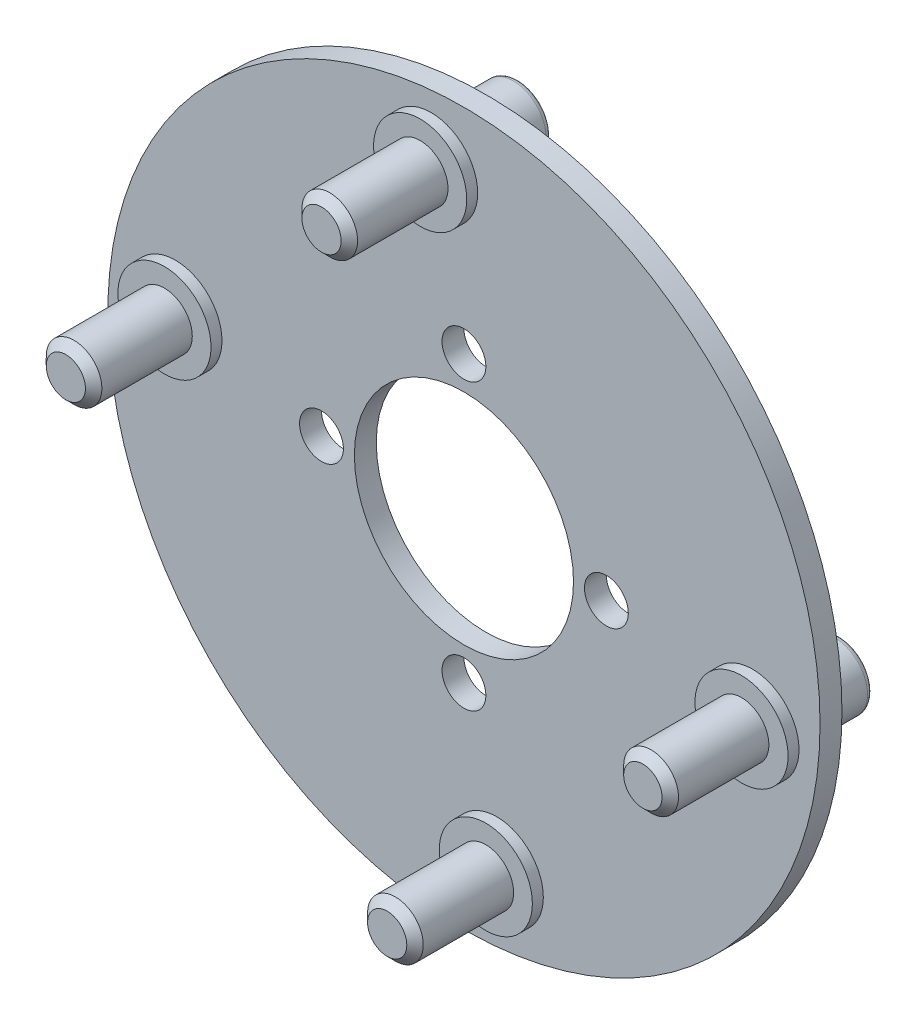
ISO-10303-21;
HEADER;
FILE_DESCRIPTION(('STEP AP214'),'2;1');
FILE_NAME('part.step','',(''),(''),'','','');
FILE_SCHEMA(('AUTOMOTIVE_DESIGN { 1 0 10303 214 1 1 1 1 }'));
ENDSEC;
DATA;
#1=APPLICATION_CONTEXT('core data for automotive mechanical design processes');
#2=APPLICATION_PROTOCOL_DEFINITION('international standard','automotive_design',2000,#1);
#3=PRODUCT_CONTEXT('',#1,'mechanical');
#4=PRODUCT('Part','Part','',(#3));
#5=PRODUCT_RELATED_PRODUCT_CATEGORY('part','',(#4));
#6=PRODUCT_DEFINITION_FORMATION('','',#4);
#7=PRODUCT_DEFINITION_CONTEXT('part definition',#1,'design');
#8=PRODUCT_DEFINITION('design','',#6,#7);
#9=PRODUCT_DEFINITION_SHAPE('','',#8);
#10=(LENGTH_UNIT() NAMED_UNIT(*) SI_UNIT(.MILLI.,.METRE.));
#11=(NAMED_UNIT(*) PLANE_ANGLE_UNIT() SI_UNIT($,.RADIAN.));
#12=(NAMED_UNIT(*) SI_UNIT($,.STERADIAN.) SOLID_ANGLE_UNIT());
#13=UNCERTAINTY_MEASURE_WITH_UNIT(LENGTH_MEASURE(1.E-05),#10,'distance_accuracy_value','');
#14=(GEOMETRIC_REPRESENTATION_CONTEXT(3) GLOBAL_UNCERTAINTY_ASSIGNED_CONTEXT((#13)) GLOBAL_UNIT_ASSIGNED_CONTEXT((#10,
#11,#12)) REPRESENTATION_CONTEXT('',''));
#15=CARTESIAN_POINT('',(0.,0.,0.));
#16=DIRECTION('',(0.,0.,1.));
#17=DIRECTION('',(1.,0.,0.));
#18=AXIS2_PLACEMENT_3D('',#15,#16,#17);
#19=CARTESIAN_POINT('',(2.9956164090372,-26.3301401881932,3.));
#20=DIRECTION('',(0.,0.,1.));
#21=DIRECTION('',(1.,0.,0.));
#22=AXIS2_PLACEMENT_3D('',#19,#20,#21);
#23=PLANE('',#22);
#24=CARTESIAN_POINT('',(2.9956164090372,-26.3301401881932,3.));
#25=DIRECTION('',(0.,0.,1.));
#26=DIRECTION('',(1.,0.,0.));
#27=AXIS2_PLACEMENT_3D('',#24,#25,#26);
#28=CIRCLE('',#27,4.25);
#29=CARTESIAN_POINT('',(7.2456164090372,-26.3301401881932,3.));
#30=VERTEX_POINT('',#29);
#31=EDGE_CURVE('E190',#30,#30,#28,.T.);
#32=ORIENTED_EDGE('',*,*,#31,.T.);
#33=EDGE_LOOP('',(#32));
#34=FACE_BOUND('',#33,.T.);
#35=CARTESIAN_POINT('',(2.9956164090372,-26.3301401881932,3.));
#36=DIRECTION('',(0.,0.,1.));
#37=DIRECTION('',(1.,0.,0.));
#38=AXIS2_PLACEMENT_3D('',#35,#36,#37);
#39=CIRCLE('',#38,2.53945180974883);
#40=CARTESIAN_POINT('',(5.53506821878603,-26.3301401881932,3.));
#41=VERTEX_POINT('',#40);
#42=EDGE_CURVE('E208',#41,#41,#39,.T.);
#43=ORIENTED_EDGE('',*,*,#42,.F.);
#44=EDGE_LOOP('',(#43));
#45=FACE_BOUND('',#44,.T.);
#46=ADVANCED_FACE('F35',(#34,#45),#23,.T.);
#47=CARTESIAN_POINT('',(-26.3301401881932,2.99561640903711,3.));
#48=DIRECTION('',(0.,0.,1.));
#49=DIRECTION('',(1.,0.,0.));
#50=AXIS2_PLACEMENT_3D('',#47,#48,#49);
#51=PLANE('',#50);
#52=CARTESIAN_POINT('',(-26.3301401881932,2.99561640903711,3.));
#53=DIRECTION('',(0.,0.,1.));
#54=DIRECTION('',(1.,0.,0.));
#55=AXIS2_PLACEMENT_3D('',#52,#53,#54);
#56=CIRCLE('',#55,4.25);
#57=CARTESIAN_POINT('',(-22.0801401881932,2.99561640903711,3.));
#58=VERTEX_POINT('',#57);
#59=EDGE_CURVE('E184',#58,#58,#56,.T.);
#60=ORIENTED_EDGE('',*,*,#59,.T.);
#61=EDGE_LOOP('',(#60));
#62=FACE_BOUND('',#61,.T.);
#63=CARTESIAN_POINT('',(-26.3301401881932,2.99561640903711,3.));
#64=DIRECTION('',(0.,0.,1.));
#65=DIRECTION('',(1.,0.,0.));
#66=AXIS2_PLACEMENT_3D('',#63,#64,#65);
#67=CIRCLE('',#66,2.53945180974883);
#68=CARTESIAN_POINT('',(-23.7906883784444,2.99561640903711,3.));
#69=VERTEX_POINT('',#68);
#70=EDGE_CURVE('E205',#69,#69,#67,.T.);
#71=ORIENTED_EDGE('',*,*,#70,.F.);
#72=EDGE_LOOP('',(#71));
#73=FACE_BOUND('',#72,.T.);
#74=ADVANCED_FACE('F215',(#62,#73),#51,.T.);
#75=CARTESIAN_POINT('',(26.3301401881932,-2.9956164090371,3.));
#76=DIRECTION('',(0.,0.,1.));
#77=DIRECTION('',(1.,0.,0.));
#78=AXIS2_PLACEMENT_3D('',#75,#76,#77);
#79=PLANE('',#78);
#80=CARTESIAN_POINT('',(26.3301401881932,-2.9956164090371,3.));
#81=DIRECTION('',(0.,0.,1.));
#82=DIRECTION('',(1.,0.,0.));
#83=AXIS2_PLACEMENT_3D('',#80,#81,#82);
#84=CIRCLE('',#83,4.25);
#85=CARTESIAN_POINT('',(30.5801401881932,-2.9956164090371,3.));
#86=VERTEX_POINT('',#85);
#87=EDGE_CURVE('E196',#86,#86,#84,.T.);
#88=ORIENTED_EDGE('',*,*,#87,.T.);
#89=EDGE_LOOP('',(#88));
#90=FACE_BOUND('',#89,.T.);
#91=CARTESIAN_POINT('',(26.3301401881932,-2.9956164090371,3.));
#92=DIRECTION('',(0.,0.,1.));
#93=DIRECTION('',(1.,0.,0.));
#94=AXIS2_PLACEMENT_3D('',#91,#92,#93);
#95=CIRCLE('',#94,2.5);
#96=CARTESIAN_POINT('',(28.8301401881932,-2.9956164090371,3.));
#97=VERTEX_POINT('',#96);
#98=EDGE_CURVE('E202',#97,#97,#95,.T.);
#99=ORIENTED_EDGE('',*,*,#98,.F.);
#100=EDGE_LOOP('',(#99));
#101=FACE_BOUND('',#100,.T.);
#102=ADVANCED_FACE('F221',(#90,#101),#79,.T.);
#103=CARTESIAN_POINT('',(-2.9956164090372,26.3301401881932,3.));
#104=DIRECTION('',(0.,0.,1.));
#105=DIRECTION('',(1.,0.,0.));
#106=AXIS2_PLACEMENT_3D('',#103,#104,#105);
#107=PLANE('',#106);
#108=CARTESIAN_POINT('',(-2.9956164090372,26.3301401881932,3.));
#109=DIRECTION('',(0.,0.,1.));
#110=DIRECTION('',(1.,0.,0.));
#111=AXIS2_PLACEMENT_3D('',#108,#109,#110);
#112=CIRCLE('',#111,4.25);
#113=CARTESIAN_POINT('',(1.2543835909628,26.3301401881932,3.));
#114=VERTEX_POINT('',#113);
#115=EDGE_CURVE('E178',#114,#114,#112,.T.);
#116=ORIENTED_EDGE('',*,*,#115,.T.);
#117=EDGE_LOOP('',(#116));
#118=FACE_BOUND('',#117,.T.);
#119=CARTESIAN_POINT('',(-2.9956164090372,26.3301401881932,3.));
#120=DIRECTION('',(0.,0.,1.));
#121=DIRECTION('',(1.,0.,0.));
#122=AXIS2_PLACEMENT_3D('',#119,#120,#121);
#123=CIRCLE('',#122,2.53945180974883);
#124=CARTESIAN_POINT('',(-0.456164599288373,26.3301401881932,3.));
#125=VERTEX_POINT('',#124);
#126=EDGE_CURVE('E199',#125,#125,#123,.T.);
#127=ORIENTED_EDGE('',*,*,#126,.F.);
#128=EDGE_LOOP('',(#127));
#129=FACE_BOUND('',#128,.T.);
#130=ADVANCED_FACE('F236',(#118,#129),#107,.T.);
#131=CARTESIAN_POINT('',(-26.3301401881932,2.99561640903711,-1.5));
#132=DIRECTION('',(0.,0.,1.));
#133=DIRECTION('',(1.,0.,0.));
#134=AXIS2_PLACEMENT_3D('',#131,#132,#133);
#135=PLANE('',#134);
#136=CARTESIAN_POINT('',(-26.3301401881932,2.99561640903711,-1.5));
#137=DIRECTION('',(0.,0.,1.));
#138=DIRECTION('',(1.,0.,0.));
#139=AXIS2_PLACEMENT_3D('',#136,#137,#138);
#140=CIRCLE('',#139,3.75);
#141=CARTESIAN_POINT('',(-22.5801401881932,2.99561640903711,-1.5));
#142=VERTEX_POINT('',#141);
#143=EDGE_CURVE('E103',#142,#142,#140,.F.);
#144=ORIENTED_EDGE('',*,*,#143,.T.);
#145=EDGE_LOOP('',(#144));
#146=FACE_BOUND('',#145,.T.);
#147=CARTESIAN_POINT('',(-26.3301401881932,2.99561640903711,-1.5));
#148=DIRECTION('',(0.,0.,1.));
#149=DIRECTION('',(1.,0.,0.));
#150=AXIS2_PLACEMENT_3D('',#147,#148,#149);
#151=CIRCLE('',#150,3.);
#152=CARTESIAN_POINT('',(-23.3301401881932,2.99561640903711,-1.5));
#153=VERTEX_POINT('',#152);
#154=EDGE_CURVE('E115',#153,#153,#151,.F.);
#155=ORIENTED_EDGE('',*,*,#154,.F.);
#156=EDGE_LOOP('',(#155));
#157=FACE_BOUND('',#156,.T.);
#158=ADVANCED_FACE('F234',(#146,#157),#135,.F.);
#159=CARTESIAN_POINT('',(2.9956164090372,-26.3301401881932,-1.5));
#160=DIRECTION('',(0.,0.,1.));
#161=DIRECTION('',(1.,0.,0.));
#162=AXIS2_PLACEMENT_3D('',#159,#160,#161);
#163=PLANE('',#162);
#164=CARTESIAN_POINT('',(2.9956164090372,-26.3301401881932,-1.5));
#165=DIRECTION('',(0.,0.,1.));
#166=DIRECTION('',(1.,0.,0.));
#167=AXIS2_PLACEMENT_3D('',#164,#165,#166);
#168=CIRCLE('',#167,3.75);
#169=CARTESIAN_POINT('',(6.7456164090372,-26.3301401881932,-1.5));
#170=VERTEX_POINT('',#169);
#171=EDGE_CURVE('E109',#170,#170,#168,.F.);
#172=ORIENTED_EDGE('',*,*,#171,.T.);
#173=EDGE_LOOP('',(#172));
#174=FACE_BOUND('',#173,.T.);
#175=CARTESIAN_POINT('',(2.9956164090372,-26.3301401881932,-1.5));
#176=DIRECTION('',(0.,0.,1.));
#177=DIRECTION('',(1.,0.,0.));
#178=AXIS2_PLACEMENT_3D('',#175,#176,#177);
#179=CIRCLE('',#178,3.);
#180=CARTESIAN_POINT('',(5.99561640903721,-26.3301401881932,-1.5));
#181=VERTEX_POINT('',#180);
#182=EDGE_CURVE('E118',#181,#181,#179,.F.);
#183=ORIENTED_EDGE('',*,*,#182,.F.);
#184=EDGE_LOOP('',(#183));
#185=FACE_BOUND('',#184,.T.);
#186=ADVANCED_FACE('F226',(#174,#185),#163,.F.);
#187=CARTESIAN_POINT('',(26.3301401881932,-2.9956164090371,-1.5));
#188=DIRECTION('',(0.,0.,1.));
#189=DIRECTION('',(1.,0.,0.));
#190=AXIS2_PLACEMENT_3D('',#187,#188,#189);
#191=PLANE('',#190);
#192=CARTESIAN_POINT('',(26.3301401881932,-2.9956164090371,-1.5));
#193=DIRECTION('',(0.,0.,1.));
#194=DIRECTION('',(1.,0.,0.));
#195=AXIS2_PLACEMENT_3D('',#192,#193,#194);
#196=CIRCLE('',#195,3.75);
#197=CARTESIAN_POINT('',(30.0801401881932,-2.9956164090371,-1.5));
#198=VERTEX_POINT('',#197);
#199=EDGE_CURVE('E91',#198,#198,#196,.F.);
#200=ORIENTED_EDGE('',*,*,#199,.T.);
#201=EDGE_LOOP('',(#200));
#202=FACE_BOUND('',#201,.T.);
#203=CARTESIAN_POINT('',(26.3301401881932,-2.9956164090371,-1.5));
#204=DIRECTION('',(0.,0.,1.));
#205=DIRECTION('',(1.,0.,0.));
#206=AXIS2_PLACEMENT_3D('',#203,#204,#205);
#207=CIRCLE('',#206,3.);
#208=CARTESIAN_POINT('',(29.3301401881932,-2.9956164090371,-1.5));
#209=VERTEX_POINT('',#208);
#210=EDGE_CURVE('E121',#209,#209,#207,.F.);
#211=ORIENTED_EDGE('',*,*,#210,.F.);
#212=EDGE_LOOP('',(#211));
#213=FACE_BOUND('',#212,.T.);
#214=ADVANCED_FACE('F248',(#202,#213),#191,.F.);
#215=CARTESIAN_POINT('',(-2.9956164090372,26.3301401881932,-1.5));
#216=DIRECTION('',(0.,0.,1.));
#217=DIRECTION('',(1.,0.,0.));
#218=AXIS2_PLACEMENT_3D('',#215,#216,#217);
#219=PLANE('',#218);
#220=CARTESIAN_POINT('',(-2.9956164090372,26.3301401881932,-1.5));
#221=DIRECTION('',(0.,0.,1.));
#222=DIRECTION('',(1.,0.,0.));
#223=AXIS2_PLACEMENT_3D('',#220,#221,#222);
#224=CIRCLE('',#223,3.75);
#225=CARTESIAN_POINT('',(0.754383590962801,26.3301401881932,-1.5));
#226=VERTEX_POINT('',#225);
#227=EDGE_CURVE('E97',#226,#226,#224,.F.);
#228=ORIENTED_EDGE('',*,*,#227,.T.);
#229=EDGE_LOOP('',(#228));
#230=FACE_BOUND('',#229,.T.);
#231=CARTESIAN_POINT('',(-2.9956164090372,26.3301401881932,-1.5));
#232=DIRECTION('',(0.,0.,1.));
#233=DIRECTION('',(1.,0.,0.));
#234=AXIS2_PLACEMENT_3D('',#231,#232,#233);
#235=CIRCLE('',#234,3.);
#236=CARTESIAN_POINT('',(0.00438359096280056,26.3301401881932,-1.5));
#237=VERTEX_POINT('',#236);
#238=EDGE_CURVE('E124',#237,#237,#235,.F.);
#239=ORIENTED_EDGE('',*,*,#238,.F.);
#240=EDGE_LOOP('',(#239));
#241=FACE_BOUND('',#240,.T.);
#242=ADVANCED_FACE('F244',(#230,#241),#219,.F.);
#243=CARTESIAN_POINT('',(0.,0.,2.));
#244=DIRECTION('',(0.,0.,1.));
#245=DIRECTION('',(1.,0.,0.));
#246=AXIS2_PLACEMENT_3D('',#243,#244,#245);
#247=PLANE('',#246);
#248=CARTESIAN_POINT('',(2.9956164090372,-26.3301401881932,2.));
#249=DIRECTION('',(0.,0.,1.));
#250=DIRECTION('',(1.,0.,0.));
#251=AXIS2_PLACEMENT_3D('',#248,#249,#250);
#252=CIRCLE('',#251,4.25);
#253=CARTESIAN_POINT('',(7.2456164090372,-26.3301401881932,2.));
#254=VERTEX_POINT('',#253);
#255=EDGE_CURVE('E187',#254,#254,#252,.F.);
#256=ORIENTED_EDGE('',*,*,#255,.T.);
#257=EDGE_LOOP('',(#256));
#258=FACE_BOUND('',#257,.T.);
#259=CARTESIAN_POINT('',(-2.9956164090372,26.3301401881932,2.));
#260=DIRECTION('',(0.,0.,1.));
#261=DIRECTION('',(1.,0.,0.));
#262=AXIS2_PLACEMENT_3D('',#259,#260,#261);
#263=CIRCLE('',#262,4.25);
#264=CARTESIAN_POINT('',(1.2543835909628,26.3301401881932,2.));
#265=VERTEX_POINT('',#264);
#266=EDGE_CURVE('E175',#265,#265,#263,.F.);
#267=ORIENTED_EDGE('',*,*,#266,.T.);
#268=EDGE_LOOP('',(#267));
#269=FACE_BOUND('',#268,.T.);
#270=CARTESIAN_POINT('',(-13.,1.36167851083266E-13,2.));
#271=DIRECTION('',(0.,0.,-1.));
#272=DIRECTION('',(0.,-1.,0.));
#273=AXIS2_PLACEMENT_3D('',#270,#271,#272);
#274=CIRCLE('',#273,2.);
#275=CARTESIAN_POINT('',(-13.,-1.99999999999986,2.));
#276=VERTEX_POINT('',#275);
#277=EDGE_CURVE('E169',#276,#276,#274,.T.);
#278=ORIENTED_EDGE('',*,*,#277,.T.);
#279=EDGE_LOOP('',(#278));
#280=FACE_BOUND('',#279,.T.);
#281=CARTESIAN_POINT('',(0.,-13.,2.));
#282=DIRECTION('',(0.,0.,-1.));
#283=DIRECTION('',(1.,0.,0.));
#284=AXIS2_PLACEMENT_3D('',#281,#282,#283);
#285=CIRCLE('',#284,2.);
#286=CARTESIAN_POINT('',(1.99999999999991,-13.,2.));
#287=VERTEX_POINT('',#286);
#288=EDGE_CURVE('E163',#287,#287,#285,.T.);
#289=ORIENTED_EDGE('',*,*,#288,.T.);
#290=EDGE_LOOP('',(#289));
#291=FACE_BOUND('',#290,.T.);
#292=CARTESIAN_POINT('',(13.,0.,2.));
#293=DIRECTION('',(0.,0.,-1.));
#294=DIRECTION('',(0.,1.,0.));
#295=AXIS2_PLACEMENT_3D('',#292,#293,#294);
#296=CIRCLE('',#295,2.);
#297=CARTESIAN_POINT('',(13.,1.99999999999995,2.));
#298=VERTEX_POINT('',#297);
#299=EDGE_CURVE('E157',#298,#298,#296,.T.);
#300=ORIENTED_EDGE('',*,*,#299,.T.);
#301=EDGE_LOOP('',(#300));
#302=FACE_BOUND('',#301,.T.);
#303=CARTESIAN_POINT('',(0.,13.,2.));
#304=DIRECTION('',(0.,0.,-1.));
#305=DIRECTION('',(-1.,0.,0.));
#306=AXIS2_PLACEMENT_3D('',#303,#304,#305);
#307=CIRCLE('',#306,2.);
#308=CARTESIAN_POINT('',(-2.,13.,2.));
#309=VERTEX_POINT('',#308);
#310=EDGE_CURVE('E151',#309,#309,#307,.T.);
#311=ORIENTED_EDGE('',*,*,#310,.T.);
#312=EDGE_LOOP('',(#311));
#313=FACE_BOUND('',#312,.T.);
#314=CARTESIAN_POINT('',(0.,0.,2.));
#315=DIRECTION('',(0.,0.,1.));
#316=DIRECTION('',(1.,0.,0.));
#317=AXIS2_PLACEMENT_3D('',#314,#315,#316);
#318=CIRCLE('',#317,32.5);
#319=CARTESIAN_POINT('',(32.5,0.,2.));
#320=VERTEX_POINT('',#319);
#321=EDGE_CURVE('E139',#320,#320,#318,.T.);
#322=ORIENTED_EDGE('',*,*,#321,.T.);
#323=EDGE_LOOP('',(#322));
#324=FACE_BOUND('',#323,.T.);
#325=CARTESIAN_POINT('',(0.,0.,2.));
#326=DIRECTION('',(0.,0.,1.));
#327=DIRECTION('',(1.,0.,0.));
#328=AXIS2_PLACEMENT_3D('',#325,#326,#327);
#329=CIRCLE('',#328,10.);
#330=CARTESIAN_POINT('',(10.,0.,2.));
#331=VERTEX_POINT('',#330);
#332=EDGE_CURVE('E145',#331,#331,#329,.T.);
#333=ORIENTED_EDGE('',*,*,#332,.F.);
#334=EDGE_LOOP('',(#333));
#335=FACE_BOUND('',#334,.T.);
#336=CARTESIAN_POINT('',(-26.3301401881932,2.99561640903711,2.));
#337=DIRECTION('',(0.,0.,1.));
#338=DIRECTION('',(1.,0.,0.));
#339=AXIS2_PLACEMENT_3D('',#336,#337,#338);
#340=CIRCLE('',#339,4.25);
#341=CARTESIAN_POINT('',(-22.0801401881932,2.99561640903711,2.));
#342=VERTEX_POINT('',#341);
#343=EDGE_CURVE('E181',#342,#342,#340,.F.);
#344=ORIENTED_EDGE('',*,*,#343,.T.);
#345=EDGE_LOOP('',(#344));
#346=FACE_BOUND('',#345,.T.);
#347=CARTESIAN_POINT('',(26.3301401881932,-2.9956164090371,2.));
#348=DIRECTION('',(0.,0.,1.));
#349=DIRECTION('',(1.,0.,0.));
#350=AXIS2_PLACEMENT_3D('',#347,#348,#349);
#351=CIRCLE('',#350,4.25);
#352=CARTESIAN_POINT('',(30.5801401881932,-2.9956164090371,2.));
#353=VERTEX_POINT('',#352);
#354=EDGE_CURVE('E193',#353,#353,#351,.F.);
#355=ORIENTED_EDGE('',*,*,#354,.T.);
#356=EDGE_LOOP('',(#355));
#357=FACE_BOUND('',#356,.T.);
#358=ADVANCED_FACE('F247',(#258,#269,#280,#291,#302,#313,#324,#335,#346,#357),#247,.T.);
#359=CARTESIAN_POINT('',(0.,0.,0.));
#360=DIRECTION('',(0.,0.,1.));
#361=DIRECTION('',(1.,0.,0.));
#362=AXIS2_PLACEMENT_3D('',#359,#360,#361);
#363=PLANE('',#362);
#364=CARTESIAN_POINT('',(2.9956164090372,-26.3301401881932,0.));
#365=DIRECTION('',(0.,0.,1.));
#366=DIRECTION('',(1.,0.,0.));
#367=AXIS2_PLACEMENT_3D('',#364,#365,#366);
#368=CIRCLE('',#367,4.25);
#369=CARTESIAN_POINT('',(7.2456164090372,-26.3301401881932,0.));
#370=VERTEX_POINT('',#369);
#371=EDGE_CURVE('E130',#370,#370,#368,.F.);
#372=ORIENTED_EDGE('',*,*,#371,.F.);
#373=EDGE_LOOP('',(#372));
#374=FACE_BOUND('',#373,.T.);
#375=CARTESIAN_POINT('',(-2.9956164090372,26.3301401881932,0.));
#376=DIRECTION('',(0.,0.,1.));
#377=DIRECTION('',(1.,0.,0.));
#378=AXIS2_PLACEMENT_3D('',#375,#376,#377);
#379=CIRCLE('',#378,4.25);
#380=CARTESIAN_POINT('',(1.2543835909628,26.3301401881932,0.));
#381=VERTEX_POINT('',#380);
#382=EDGE_CURVE('E136',#381,#381,#379,.F.);
#383=ORIENTED_EDGE('',*,*,#382,.F.);
#384=EDGE_LOOP('',(#383));
#385=FACE_BOUND('',#384,.T.);
#386=CARTESIAN_POINT('',(-13.,1.36167851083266E-13,0.));
#387=DIRECTION('',(0.,0.,-1.));
#388=DIRECTION('',(0.,-1.,0.));
#389=AXIS2_PLACEMENT_3D('',#386,#387,#388);
#390=CIRCLE('',#389,2.);
#391=CARTESIAN_POINT('',(-13.,-1.99999999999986,0.));
#392=VERTEX_POINT('',#391);
#393=EDGE_CURVE('E172',#392,#392,#390,.T.);
#394=ORIENTED_EDGE('',*,*,#393,.F.);
#395=EDGE_LOOP('',(#394));
#396=FACE_BOUND('',#395,.T.);
#397=CARTESIAN_POINT('',(0.,-13.,0.));
#398=DIRECTION('',(0.,0.,-1.));
#399=DIRECTION('',(1.,0.,0.));
#400=AXIS2_PLACEMENT_3D('',#397,#398,#399);
#401=CIRCLE('',#400,2.);
#402=CARTESIAN_POINT('',(1.99999999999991,-13.,0.));
#403=VERTEX_POINT('',#402);
#404=EDGE_CURVE('E166',#403,#403,#401,.T.);
#405=ORIENTED_EDGE('',*,*,#404,.F.);
#406=EDGE_LOOP('',(#405));
#407=FACE_BOUND('',#406,.T.);
#408=CARTESIAN_POINT('',(13.,0.,0.));
#409=DIRECTION('',(0.,0.,-1.));
#410=DIRECTION('',(0.,1.,0.));
#411=AXIS2_PLACEMENT_3D('',#408,#409,#410);
#412=CIRCLE('',#411,2.);
#413=CARTESIAN_POINT('',(13.,1.99999999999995,0.));
#414=VERTEX_POINT('',#413);
#415=EDGE_CURVE('E160',#414,#414,#412,.T.);
#416=ORIENTED_EDGE('',*,*,#415,.F.);
#417=EDGE_LOOP('',(#416));
#418=FACE_BOUND('',#417,.T.);
#419=CARTESIAN_POINT('',(0.,13.,0.));
#420=DIRECTION('',(0.,0.,-1.));
#421=DIRECTION('',(-1.,0.,0.));
#422=AXIS2_PLACEMENT_3D('',#419,#420,#421);
#423=CIRCLE('',#422,2.);
#424=CARTESIAN_POINT('',(-2.,13.,0.));
#425=VERTEX_POINT('',#424);
#426=EDGE_CURVE('E154',#425,#425,#423,.T.);
#427=ORIENTED_EDGE('',*,*,#426,.F.);
#428=EDGE_LOOP('',(#427));
#429=FACE_BOUND('',#428,.T.);
#430=CARTESIAN_POINT('',(0.,0.,0.));
#431=DIRECTION('',(0.,0.,1.));
#432=DIRECTION('',(1.,0.,0.));
#433=AXIS2_PLACEMENT_3D('',#430,#431,#432);
#434=CIRCLE('',#433,32.5);
#435=CARTESIAN_POINT('',(32.5,0.,0.));
#436=VERTEX_POINT('',#435);
#437=EDGE_CURVE('E142',#436,#436,#434,.T.);
#438=ORIENTED_EDGE('',*,*,#437,.F.);
#439=EDGE_LOOP('',(#438));
#440=FACE_BOUND('',#439,.T.);
#441=CARTESIAN_POINT('',(0.,0.,0.));
#442=DIRECTION('',(0.,0.,1.));
#443=DIRECTION('',(1.,0.,0.));
#444=AXIS2_PLACEMENT_3D('',#441,#442,#443);
#445=CIRCLE('',#444,10.);
#446=CARTESIAN_POINT('',(10.,0.,0.));
#447=VERTEX_POINT('',#446);
#448=EDGE_CURVE('E148',#447,#447,#445,.T.);
#449=ORIENTED_EDGE('',*,*,#448,.T.);
#450=EDGE_LOOP('',(#449));
#451=FACE_BOUND('',#450,.T.);
#452=CARTESIAN_POINT('',(-26.3301401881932,2.99561640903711,0.));
#453=DIRECTION('',(0.,0.,1.));
#454=DIRECTION('',(1.,0.,0.));
#455=AXIS2_PLACEMENT_3D('',#452,#453,#454);
#456=CIRCLE('',#455,4.25);
#457=CARTESIAN_POINT('',(-22.0801401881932,2.99561640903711,0.));
#458=VERTEX_POINT('',#457);
#459=EDGE_CURVE('E133',#458,#458,#456,.F.);
#460=ORIENTED_EDGE('',*,*,#459,.F.);
#461=EDGE_LOOP('',(#460));
#462=FACE_BOUND('',#461,.T.);
#463=CARTESIAN_POINT('',(26.3301401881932,-2.9956164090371,0.));
#464=DIRECTION('',(0.,0.,1.));
#465=DIRECTION('',(1.,0.,0.));
#466=AXIS2_PLACEMENT_3D('',#463,#464,#465);
#467=CIRCLE('',#466,4.25);
#468=CARTESIAN_POINT('',(30.5801401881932,-2.9956164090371,0.));
#469=VERTEX_POINT('',#468);
#470=EDGE_CURVE('E127',#469,#469,#467,.F.);
#471=ORIENTED_EDGE('',*,*,#470,.F.);
#472=EDGE_LOOP('',(#471));
#473=FACE_BOUND('',#472,.T.);
#474=ADVANCED_FACE('F278',(#374,#385,#396,#407,#418,#429,#440,#451,#462,#473),#363,.F.);
#475=CARTESIAN_POINT('',(0.,0.,2.));
#476=DIRECTION('',(0.,0.,-1.));
#477=DIRECTION('',(-1.,0.,0.));
#478=AXIS2_PLACEMENT_3D('',#475,#476,#477);
#479=CYLINDRICAL_SURFACE('',#478,32.5);
#480=ORIENTED_EDGE('',*,*,#321,.F.);
#481=EDGE_LOOP('',(#480));
#482=FACE_BOUND('',#481,.T.);
#483=ORIENTED_EDGE('',*,*,#437,.T.);
#484=EDGE_LOOP('',(#483));
#485=FACE_BOUND('',#484,.T.);
#486=ADVANCED_FACE('F37',(#482,#485),#479,.T.);
#487=CARTESIAN_POINT('',(0.,0.,2.));
#488=DIRECTION('',(0.,0.,-1.));
#489=DIRECTION('',(-1.,0.,0.));
#490=AXIS2_PLACEMENT_3D('',#487,#488,#489);
#491=CYLINDRICAL_SURFACE('',#490,10.);
#492=ORIENTED_EDGE('',*,*,#332,.T.);
#493=EDGE_LOOP('',(#492));
#494=FACE_BOUND('',#493,.T.);
#495=ORIENTED_EDGE('',*,*,#448,.F.);
#496=EDGE_LOOP('',(#495));
#497=FACE_BOUND('',#496,.T.);
#498=ADVANCED_FACE('F273',(#494,#497),#491,.F.);
#499=CARTESIAN_POINT('',(0.,13.,2.));
#500=DIRECTION('',(0.,0.,-1.));
#501=DIRECTION('',(-1.,0.,0.));
#502=AXIS2_PLACEMENT_3D('',#499,#500,#501);
#503=CYLINDRICAL_SURFACE('',#502,2.);
#504=ORIENTED_EDGE('',*,*,#310,.F.);
#505=EDGE_LOOP('',(#504));
#506=FACE_BOUND('',#505,.T.);
#507=ORIENTED_EDGE('',*,*,#426,.T.);
#508=EDGE_LOOP('',(#507));
#509=FACE_BOUND('',#508,.T.);
#510=ADVANCED_FACE('F269',(#506,#509),#503,.F.);
#511=CARTESIAN_POINT('',(13.,0.,2.));
#512=DIRECTION('',(0.,0.,-1.));
#513=DIRECTION('',(-1.,0.,0.));
#514=AXIS2_PLACEMENT_3D('',#511,#512,#513);
#515=CYLINDRICAL_SURFACE('',#514,2.);
#516=ORIENTED_EDGE('',*,*,#299,.F.);
#517=EDGE_LOOP('',(#516));
#518=FACE_BOUND('',#517,.T.);
#519=ORIENTED_EDGE('',*,*,#415,.T.);
#520=EDGE_LOOP('',(#519));
#521=FACE_BOUND('',#520,.T.);
#522=ADVANCED_FACE('F265',(#518,#521),#515,.F.);
#523=CARTESIAN_POINT('',(0.,-13.,2.));
#524=DIRECTION('',(0.,0.,-1.));
#525=DIRECTION('',(-1.,0.,0.));
#526=AXIS2_PLACEMENT_3D('',#523,#524,#525);
#527=CYLINDRICAL_SURFACE('',#526,2.);
#528=ORIENTED_EDGE('',*,*,#288,.F.);
#529=EDGE_LOOP('',(#528));
#530=FACE_BOUND('',#529,.T.);
#531=ORIENTED_EDGE('',*,*,#404,.T.);
#532=EDGE_LOOP('',(#531));
#533=FACE_BOUND('',#532,.T.);
#534=ADVANCED_FACE('F261',(#530,#533),#527,.F.);
#535=CARTESIAN_POINT('',(-13.,1.36167851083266E-13,2.));
#536=DIRECTION('',(0.,0.,-1.));
#537=DIRECTION('',(-1.,0.,0.));
#538=AXIS2_PLACEMENT_3D('',#535,#536,#537);
#539=CYLINDRICAL_SURFACE('',#538,2.);
#540=ORIENTED_EDGE('',*,*,#277,.F.);
#541=EDGE_LOOP('',(#540));
#542=FACE_BOUND('',#541,.T.);
#543=ORIENTED_EDGE('',*,*,#393,.T.);
#544=EDGE_LOOP('',(#543));
#545=FACE_BOUND('',#544,.T.);
#546=ADVANCED_FACE('F258',(#542,#545),#539,.F.);
#547=CARTESIAN_POINT('',(-2.9956164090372,26.3301401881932,3.));
#548=DIRECTION('',(0.,0.,-1.));
#549=DIRECTION('',(-1.,0.,0.));
#550=AXIS2_PLACEMENT_3D('',#547,#548,#549);
#551=CYLINDRICAL_SURFACE('',#550,4.25);
#552=CARTESIAN_POINT('',(-2.9956164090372,26.3301401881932,-1.));
#553=DIRECTION('',(0.,0.,1.));
#554=DIRECTION('',(1.,0.,0.));
#555=AXIS2_PLACEMENT_3D('',#552,#553,#554);
#556=CIRCLE('',#555,4.25);
#557=CARTESIAN_POINT('',(1.2543835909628,26.3301401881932,-1.));
#558=VERTEX_POINT('',#557);
#559=EDGE_CURVE('E100',#558,#558,#556,.T.);
#560=ORIENTED_EDGE('',*,*,#559,.T.);
#561=EDGE_LOOP('',(#560));
#562=FACE_BOUND('',#561,.T.);
#563=ORIENTED_EDGE('',*,*,#382,.T.);
#564=EDGE_LOOP('',(#563));
#565=FACE_BOUND('',#564,.T.);
#566=ADVANCED_FACE('F256',(#562,#565),#551,.T.);
#567=ORIENTED_EDGE('',*,*,#266,.F.);
#568=EDGE_LOOP('',(#567));
#569=FACE_BOUND('',#568,.T.);
#570=ORIENTED_EDGE('',*,*,#115,.F.);
#571=EDGE_LOOP('',(#570));
#572=FACE_BOUND('',#571,.T.);
#573=ADVANCED_FACE('F253',(#569,#572),#551,.T.);
#574=CARTESIAN_POINT('',(-26.3301401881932,2.99561640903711,3.));
#575=DIRECTION('',(0.,0.,-1.));
#576=DIRECTION('',(-1.,0.,0.));
#577=AXIS2_PLACEMENT_3D('',#574,#575,#576);
#578=CYLINDRICAL_SURFACE('',#577,4.25);
#579=CARTESIAN_POINT('',(-26.3301401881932,2.99561640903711,-1.));
#580=DIRECTION('',(0.,0.,1.));
#581=DIRECTION('',(1.,0.,0.));
#582=AXIS2_PLACEMENT_3D('',#579,#580,#581);
#583=CIRCLE('',#582,4.25);
#584=CARTESIAN_POINT('',(-22.0801401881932,2.99561640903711,-1.));
#585=VERTEX_POINT('',#584);
#586=EDGE_CURVE('E106',#585,#585,#583,.T.);
#587=ORIENTED_EDGE('',*,*,#586,.T.);
#588=EDGE_LOOP('',(#587));
#589=FACE_BOUND('',#588,.T.);
#590=ORIENTED_EDGE('',*,*,#459,.T.);
#591=EDGE_LOOP('',(#590));
#592=FACE_BOUND('',#591,.T.);
#593=ADVANCED_FACE('F242',(#589,#592),#578,.T.);
#594=ORIENTED_EDGE('',*,*,#343,.F.);
#595=EDGE_LOOP('',(#594));
#596=FACE_BOUND('',#595,.T.);
#597=ORIENTED_EDGE('',*,*,#59,.F.);
#598=EDGE_LOOP('',(#597));
#599=FACE_BOUND('',#598,.T.);
#600=ADVANCED_FACE('F239',(#596,#599),#578,.T.);
#601=CARTESIAN_POINT('',(2.9956164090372,-26.3301401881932,3.));
#602=DIRECTION('',(0.,0.,-1.));
#603=DIRECTION('',(-1.,0.,0.));
#604=AXIS2_PLACEMENT_3D('',#601,#602,#603);
#605=CYLINDRICAL_SURFACE('',#604,4.25);
#606=CARTESIAN_POINT('',(2.9956164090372,-26.3301401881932,-1.));
#607=DIRECTION('',(0.,0.,1.));
#608=DIRECTION('',(1.,0.,0.));
#609=AXIS2_PLACEMENT_3D('',#606,#607,#608);
#610=CIRCLE('',#609,4.25);
#611=CARTESIAN_POINT('',(7.2456164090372,-26.3301401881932,-1.));
#612=VERTEX_POINT('',#611);
#613=EDGE_CURVE('E112',#612,#612,#610,.T.);
#614=ORIENTED_EDGE('',*,*,#613,.T.);
#615=EDGE_LOOP('',(#614));
#616=FACE_BOUND('',#615,.T.);
#617=ORIENTED_EDGE('',*,*,#371,.T.);
#618=EDGE_LOOP('',(#617));
#619=FACE_BOUND('',#618,.T.);
#620=ADVANCED_FACE('F232',(#616,#619),#605,.T.);
#621=ORIENTED_EDGE('',*,*,#255,.F.);
#622=EDGE_LOOP('',(#621));
#623=FACE_BOUND('',#622,.T.);
#624=ORIENTED_EDGE('',*,*,#31,.F.);
#625=EDGE_LOOP('',(#624));
#626=FACE_BOUND('',#625,.T.);
#627=ADVANCED_FACE('F228',(#623,#626),#605,.T.);
#628=CARTESIAN_POINT('',(26.3301401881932,-2.9956164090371,3.));
#629=DIRECTION('',(0.,0.,-1.));
#630=DIRECTION('',(-1.,0.,0.));
#631=AXIS2_PLACEMENT_3D('',#628,#629,#630);
#632=CYLINDRICAL_SURFACE('',#631,4.25);
#633=CARTESIAN_POINT('',(26.3301401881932,-2.9956164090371,-1.));
#634=DIRECTION('',(0.,0.,1.));
#635=DIRECTION('',(1.,0.,0.));
#636=AXIS2_PLACEMENT_3D('',#633,#634,#635);
#637=CIRCLE('',#636,4.25);
#638=CARTESIAN_POINT('',(30.5801401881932,-2.9956164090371,-1.));
#639=VERTEX_POINT('',#638);
#640=EDGE_CURVE('E94',#639,#639,#637,.T.);
#641=ORIENTED_EDGE('',*,*,#640,.T.);
#642=EDGE_LOOP('',(#641));
#643=FACE_BOUND('',#642,.T.);
#644=ORIENTED_EDGE('',*,*,#470,.T.);
#645=EDGE_LOOP('',(#644));
#646=FACE_BOUND('',#645,.T.);
#647=ADVANCED_FACE('F231',(#643,#646),#632,.T.);
#648=ORIENTED_EDGE('',*,*,#354,.F.);
#649=EDGE_LOOP('',(#648));
#650=FACE_BOUND('',#649,.T.);
#651=ORIENTED_EDGE('',*,*,#87,.F.);
#652=EDGE_LOOP('',(#651));
#653=FACE_BOUND('',#652,.T.);
#654=ADVANCED_FACE('F305',(#650,#653),#632,.T.);
#655=CARTESIAN_POINT('',(-2.9956164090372,26.3301401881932,-6.));
#656=DIRECTION('',(0.,0.,1.));
#657=DIRECTION('',(1.,0.,0.));
#658=AXIS2_PLACEMENT_3D('',#655,#656,#657);
#659=CYLINDRICAL_SURFACE('',#658,3.);
#660=CARTESIAN_POINT('',(-2.9956164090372,26.3301401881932,-5.5));
#661=DIRECTION('',(0.,0.,-1.));
#662=DIRECTION('',(-1.,0.,0.));
#663=AXIS2_PLACEMENT_3D('',#660,#661,#662);
#664=CIRCLE('',#663,3.);
#665=CARTESIAN_POINT('',(-5.9956164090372,26.3301401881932,-5.5));
#666=VERTEX_POINT('',#665);
#667=EDGE_CURVE('E67',#666,#666,#664,.F.);
#668=ORIENTED_EDGE('',*,*,#667,.T.);
#669=EDGE_LOOP('',(#668));
#670=FACE_BOUND('',#669,.T.);
#671=ORIENTED_EDGE('',*,*,#238,.T.);
#672=EDGE_LOOP('',(#671));
#673=FACE_BOUND('',#672,.T.);
#674=ADVANCED_FACE('F308',(#670,#673),#659,.T.);
#675=CARTESIAN_POINT('',(-2.9956164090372,26.3301401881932,-6.));
#676=DIRECTION('',(0.,0.,-1.));
#677=DIRECTION('',(-1.,0.,0.));
#678=AXIS2_PLACEMENT_3D('',#675,#676,#677);
#679=PLANE('',#678);
#680=CARTESIAN_POINT('',(-2.9956164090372,26.3301401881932,-6.));
#681=DIRECTION('',(0.,0.,-1.));
#682=DIRECTION('',(-1.,0.,0.));
#683=AXIS2_PLACEMENT_3D('',#680,#681,#682);
#684=CIRCLE('',#683,2.5);
#685=CARTESIAN_POINT('',(-5.4956164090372,26.3301401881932,-6.));
#686=VERTEX_POINT('',#685);
#687=EDGE_CURVE('E70',#686,#686,#684,.T.);
#688=ORIENTED_EDGE('',*,*,#687,.T.);
#689=EDGE_LOOP('',(#688));
#690=FACE_BOUND('',#689,.T.);
#691=ADVANCED_FACE('F390',(#690),#679,.T.);
#692=CARTESIAN_POINT('',(26.3301401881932,-2.9956164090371,-6.));
#693=DIRECTION('',(0.,0.,1.));
#694=DIRECTION('',(1.,0.,0.));
#695=AXIS2_PLACEMENT_3D('',#692,#693,#694);
#696=CYLINDRICAL_SURFACE('',#695,3.);
#697=CARTESIAN_POINT('',(26.3301401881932,-2.9956164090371,-5.5));
#698=DIRECTION('',(0.,0.,-1.));
#699=DIRECTION('',(-1.,0.,0.));
#700=AXIS2_PLACEMENT_3D('',#697,#698,#699);
#701=CIRCLE('',#700,3.);
#702=CARTESIAN_POINT('',(23.3301401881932,-2.9956164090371,-5.5));
#703=VERTEX_POINT('',#702);
#704=EDGE_CURVE('E73',#703,#703,#701,.F.);
#705=ORIENTED_EDGE('',*,*,#704,.T.);
#706=EDGE_LOOP('',(#705));
#707=FACE_BOUND('',#706,.T.);
#708=ORIENTED_EDGE('',*,*,#210,.T.);
#709=EDGE_LOOP('',(#708));
#710=FACE_BOUND('',#709,.T.);
#711=ADVANCED_FACE('F386',(#707,#710),#696,.T.);
#712=CARTESIAN_POINT('',(26.3301401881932,-2.9956164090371,-6.));
#713=DIRECTION('',(0.,0.,-1.));
#714=DIRECTION('',(-1.,0.,0.));
#715=AXIS2_PLACEMENT_3D('',#712,#713,#714);
#716=PLANE('',#715);
#717=CARTESIAN_POINT('',(26.3301401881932,-2.9956164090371,-6.));
#718=DIRECTION('',(0.,0.,-1.));
#719=DIRECTION('',(-1.,0.,0.));
#720=AXIS2_PLACEMENT_3D('',#717,#718,#719);
#721=CIRCLE('',#720,2.5);
#722=CARTESIAN_POINT('',(23.8301401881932,-2.9956164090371,-6.));
#723=VERTEX_POINT('',#722);
#724=EDGE_CURVE('E76',#723,#723,#721,.T.);
#725=ORIENTED_EDGE('',*,*,#724,.T.);
#726=EDGE_LOOP('',(#725));
#727=FACE_BOUND('',#726,.T.);
#728=ADVANCED_FACE('F382',(#727),#716,.T.);
#729=CARTESIAN_POINT('',(2.9956164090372,-26.3301401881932,-6.));
#730=DIRECTION('',(0.,0.,1.));
#731=DIRECTION('',(1.,0.,0.));
#732=AXIS2_PLACEMENT_3D('',#729,#730,#731);
#733=CYLINDRICAL_SURFACE('',#732,3.);
#734=CARTESIAN_POINT('',(2.9956164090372,-26.3301401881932,-5.5));
#735=DIRECTION('',(0.,0.,-1.));
#736=DIRECTION('',(-1.,0.,0.));
#737=AXIS2_PLACEMENT_3D('',#734,#735,#736);
#738=CIRCLE('',#737,3.);
#739=CARTESIAN_POINT('',(-0.00438359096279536,-26.3301401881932,-5.5));
#740=VERTEX_POINT('',#739);
#741=EDGE_CURVE('E79',#740,#740,#738,.F.);
#742=ORIENTED_EDGE('',*,*,#741,.T.);
#743=EDGE_LOOP('',(#742));
#744=FACE_BOUND('',#743,.T.);
#745=ORIENTED_EDGE('',*,*,#182,.T.);
#746=EDGE_LOOP('',(#745));
#747=FACE_BOUND('',#746,.T.);
#748=ADVANCED_FACE('F378',(#744,#747),#733,.T.);
#749=CARTESIAN_POINT('',(2.9956164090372,-26.3301401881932,-6.));
#750=DIRECTION('',(0.,0.,-1.));
#751=DIRECTION('',(-1.,0.,0.));
#752=AXIS2_PLACEMENT_3D('',#749,#750,#751);
#753=PLANE('',#752);
#754=CARTESIAN_POINT('',(2.9956164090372,-26.3301401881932,-6.));
#755=DIRECTION('',(0.,0.,-1.));
#756=DIRECTION('',(-1.,0.,0.));
#757=AXIS2_PLACEMENT_3D('',#754,#755,#756);
#758=CIRCLE('',#757,2.5);
#759=CARTESIAN_POINT('',(0.495616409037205,-26.3301401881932,-6.));
#760=VERTEX_POINT('',#759);
#761=EDGE_CURVE('E82',#760,#760,#758,.T.);
#762=ORIENTED_EDGE('',*,*,#761,.T.);
#763=EDGE_LOOP('',(#762));
#764=FACE_BOUND('',#763,.T.);
#765=ADVANCED_FACE('F374',(#764),#753,.T.);
#766=CARTESIAN_POINT('',(-26.3301401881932,2.99561640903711,-6.));
#767=DIRECTION('',(0.,0.,1.));
#768=DIRECTION('',(1.,0.,0.));
#769=AXIS2_PLACEMENT_3D('',#766,#767,#768);
#770=CYLINDRICAL_SURFACE('',#769,3.);
#771=CARTESIAN_POINT('',(-26.3301401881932,2.99561640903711,-5.5));
#772=DIRECTION('',(0.,0.,-1.));
#773=DIRECTION('',(-1.,0.,0.));
#774=AXIS2_PLACEMENT_3D('',#771,#772,#773);
#775=CIRCLE('',#774,3.);
#776=CARTESIAN_POINT('',(-29.3301401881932,2.99561640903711,-5.5));
#777=VERTEX_POINT('',#776);
#778=EDGE_CURVE('E85',#777,#777,#775,.F.);
#779=ORIENTED_EDGE('',*,*,#778,.T.);
#780=EDGE_LOOP('',(#779));
#781=FACE_BOUND('',#780,.T.);
#782=ORIENTED_EDGE('',*,*,#154,.T.);
#783=EDGE_LOOP('',(#782));
#784=FACE_BOUND('',#783,.T.);
#785=ADVANCED_FACE('F370',(#781,#784),#770,.T.);
#786=CARTESIAN_POINT('',(-26.3301401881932,2.99561640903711,-6.));
#787=DIRECTION('',(0.,0.,-1.));
#788=DIRECTION('',(-1.,0.,0.));
#789=AXIS2_PLACEMENT_3D('',#786,#787,#788);
#790=PLANE('',#789);
#791=CARTESIAN_POINT('',(-26.3301401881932,2.99561640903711,-6.));
#792=DIRECTION('',(0.,0.,-1.));
#793=DIRECTION('',(-1.,0.,0.));
#794=AXIS2_PLACEMENT_3D('',#791,#792,#793);
#795=CIRCLE('',#794,2.5);
#796=CARTESIAN_POINT('',(-28.8301401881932,2.99561640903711,-6.));
#797=VERTEX_POINT('',#796);
#798=EDGE_CURVE('E88',#797,#797,#795,.T.);
#799=ORIENTED_EDGE('',*,*,#798,.T.);
#800=EDGE_LOOP('',(#799));
#801=FACE_BOUND('',#800,.T.);
#802=ADVANCED_FACE('F366',(#801),#790,.T.);
#803=CARTESIAN_POINT('',(2.9956164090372,-26.3301401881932,-1.));
#804=DIRECTION('',(0.,0.,1.));
#805=DIRECTION('',(1.,0.,0.));
#806=AXIS2_PLACEMENT_3D('',#803,#804,#805);
#807=TOROIDAL_SURFACE('',#806,3.75,0.5);
#808=ORIENTED_EDGE('',*,*,#171,.F.);
#809=EDGE_LOOP('',(#808));
#810=FACE_BOUND('',#809,.T.);
#811=ORIENTED_EDGE('',*,*,#613,.F.);
#812=EDGE_LOOP('',(#811));
#813=FACE_BOUND('',#812,.T.);
#814=ADVANCED_FACE('F362',(#810,#813),#807,.T.);
#815=CARTESIAN_POINT('',(-26.3301401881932,2.99561640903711,-1.));
#816=DIRECTION('',(0.,0.,1.));
#817=DIRECTION('',(1.,0.,0.));
#818=AXIS2_PLACEMENT_3D('',#815,#816,#817);
#819=TOROIDAL_SURFACE('',#818,3.75,0.5);
#820=ORIENTED_EDGE('',*,*,#143,.F.);
#821=EDGE_LOOP('',(#820));
#822=FACE_BOUND('',#821,.T.);
#823=ORIENTED_EDGE('',*,*,#586,.F.);
#824=EDGE_LOOP('',(#823));
#825=FACE_BOUND('',#824,.T.);
#826=ADVANCED_FACE('F358',(#822,#825),#819,.T.);
#827=CARTESIAN_POINT('',(-2.9956164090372,26.3301401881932,-1.));
#828=DIRECTION('',(0.,0.,1.));
#829=DIRECTION('',(1.,0.,0.));
#830=AXIS2_PLACEMENT_3D('',#827,#828,#829);
#831=TOROIDAL_SURFACE('',#830,3.75,0.5);
#832=ORIENTED_EDGE('',*,*,#227,.F.);
#833=EDGE_LOOP('',(#832));
#834=FACE_BOUND('',#833,.T.);
#835=ORIENTED_EDGE('',*,*,#559,.F.);
#836=EDGE_LOOP('',(#835));
#837=FACE_BOUND('',#836,.T.);
#838=ADVANCED_FACE('F354',(#834,#837),#831,.T.);
#839=CARTESIAN_POINT('',(26.3301401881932,-2.9956164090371,-1.));
#840=DIRECTION('',(0.,0.,1.));
#841=DIRECTION('',(1.,0.,0.));
#842=AXIS2_PLACEMENT_3D('',#839,#840,#841);
#843=TOROIDAL_SURFACE('',#842,3.75,0.5);
#844=ORIENTED_EDGE('',*,*,#199,.F.);
#845=EDGE_LOOP('',(#844));
#846=FACE_BOUND('',#845,.T.);
#847=ORIENTED_EDGE('',*,*,#640,.F.);
#848=EDGE_LOOP('',(#847));
#849=FACE_BOUND('',#848,.T.);
#850=ADVANCED_FACE('F350',(#846,#849),#843,.T.);
#851=CARTESIAN_POINT('',(-26.3301401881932,2.99561640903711,-5.5));
#852=DIRECTION('',(0.,0.,-1.));
#853=DIRECTION('',(-1.,0.,0.));
#854=AXIS2_PLACEMENT_3D('',#851,#852,#853);
#855=TOROIDAL_SURFACE('',#854,2.5,0.5);
#856=ORIENTED_EDGE('',*,*,#778,.F.);
#857=EDGE_LOOP('',(#856));
#858=FACE_BOUND('',#857,.T.);
#859=ORIENTED_EDGE('',*,*,#798,.F.);
#860=EDGE_LOOP('',(#859));
#861=FACE_BOUND('',#860,.T.);
#862=ADVANCED_FACE('F346',(#858,#861),#855,.T.);
#863=CARTESIAN_POINT('',(2.9956164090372,-26.3301401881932,-5.5));
#864=DIRECTION('',(0.,0.,-1.));
#865=DIRECTION('',(-1.,0.,0.));
#866=AXIS2_PLACEMENT_3D('',#863,#864,#865);
#867=TOROIDAL_SURFACE('',#866,2.5,0.5);
#868=ORIENTED_EDGE('',*,*,#741,.F.);
#869=EDGE_LOOP('',(#868));
#870=FACE_BOUND('',#869,.T.);
#871=ORIENTED_EDGE('',*,*,#761,.F.);
#872=EDGE_LOOP('',(#871));
#873=FACE_BOUND('',#872,.T.);
#874=ADVANCED_FACE('F342',(#870,#873),#867,.T.);
#875=CARTESIAN_POINT('',(26.3301401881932,-2.9956164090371,-5.5));
#876=DIRECTION('',(0.,0.,-1.));
#877=DIRECTION('',(-1.,0.,0.));
#878=AXIS2_PLACEMENT_3D('',#875,#876,#877);
#879=TOROIDAL_SURFACE('',#878,2.5,0.5);
#880=ORIENTED_EDGE('',*,*,#704,.F.);
#881=EDGE_LOOP('',(#880));
#882=FACE_BOUND('',#881,.T.);
#883=ORIENTED_EDGE('',*,*,#724,.F.);
#884=EDGE_LOOP('',(#883));
#885=FACE_BOUND('',#884,.T.);
#886=ADVANCED_FACE('F338',(#882,#885),#879,.T.);
#887=CARTESIAN_POINT('',(-2.9956164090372,26.3301401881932,-5.5));
#888=DIRECTION('',(0.,0.,-1.));
#889=DIRECTION('',(-1.,0.,0.));
#890=AXIS2_PLACEMENT_3D('',#887,#888,#889);
#891=TOROIDAL_SURFACE('',#890,2.5,0.5);
#892=ORIENTED_EDGE('',*,*,#667,.F.);
#893=EDGE_LOOP('',(#892));
#894=FACE_BOUND('',#893,.T.);
#895=ORIENTED_EDGE('',*,*,#687,.F.);
#896=EDGE_LOOP('',(#895));
#897=FACE_BOUND('',#896,.T.);
#898=ADVANCED_FACE('F334',(#894,#897),#891,.T.);
#899=CARTESIAN_POINT('',(-2.9956164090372,26.3301401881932,12.));
#900=DIRECTION('',(0.,0.,-1.));
#901=DIRECTION('',(-1.,0.,0.));
#902=AXIS2_PLACEMENT_3D('',#899,#900,#901);
#903=CYLINDRICAL_SURFACE('',#902,2.53945180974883);
#904=CARTESIAN_POINT('',(-2.9956164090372,26.3301401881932,11.25));
#905=DIRECTION('',(0.,0.,1.));
#906=DIRECTION('',(1.,0.,0.));
#907=AXIS2_PLACEMENT_3D('',#904,#905,#906);
#908=CIRCLE('',#907,2.53945180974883);
#909=CARTESIAN_POINT('',(-0.456164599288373,26.3301401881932,11.25));
#910=VERTEX_POINT('',#909);
#911=EDGE_CURVE('E61',#910,#910,#908,.F.);
#912=ORIENTED_EDGE('',*,*,#911,.T.);
#913=EDGE_LOOP('',(#912));
#914=FACE_BOUND('',#913,.T.);
#915=ORIENTED_EDGE('',*,*,#126,.T.);
#916=EDGE_LOOP('',(#915));
#917=FACE_BOUND('',#916,.T.);
#918=ADVANCED_FACE('F327',(#914,#917),#903,.T.);
#919=CARTESIAN_POINT('',(-2.9956164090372,26.3301401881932,12.));
#920=DIRECTION('',(0.,0.,1.));
#921=DIRECTION('',(1.,0.,0.));
#922=AXIS2_PLACEMENT_3D('',#919,#920,#921);
#923=PLANE('',#922);
#924=CARTESIAN_POINT('',(-2.9956164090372,26.3301401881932,12.));
#925=DIRECTION('',(0.,0.,1.));
#926=DIRECTION('',(1.,0.,0.));
#927=AXIS2_PLACEMENT_3D('',#924,#925,#926);
#928=CIRCLE('',#927,1.78945180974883);
#929=CARTESIAN_POINT('',(-1.20616459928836,26.3301401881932,12.));
#930=VERTEX_POINT('',#929);
#931=EDGE_CURVE('E64',#930,#930,#928,.T.);
#932=ORIENTED_EDGE('',*,*,#931,.T.);
#933=EDGE_LOOP('',(#932));
#934=FACE_BOUND('',#933,.T.);
#935=ADVANCED_FACE('F319',(#934),#923,.T.);
#936=CARTESIAN_POINT('',(26.3301401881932,-2.9956164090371,12.));
#937=DIRECTION('',(0.,0.,-1.));
#938=DIRECTION('',(-1.,0.,0.));
#939=AXIS2_PLACEMENT_3D('',#936,#937,#938);
#940=CYLINDRICAL_SURFACE('',#939,2.5);
#941=CARTESIAN_POINT('',(26.3301401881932,-2.9956164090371,11.25));
#942=DIRECTION('',(0.,0.,1.));
#943=DIRECTION('',(1.,0.,0.));
#944=AXIS2_PLACEMENT_3D('',#941,#942,#943);
#945=CIRCLE('',#944,2.5);
#946=CARTESIAN_POINT('',(28.8301401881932,-2.9956164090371,11.25));
#947=VERTEX_POINT('',#946);
#948=EDGE_CURVE('E10',#947,#947,#945,.F.);
#949=ORIENTED_EDGE('',*,*,#948,.T.);
#950=EDGE_LOOP('',(#949));
#951=FACE_BOUND('',#950,.T.);
#952=ORIENTED_EDGE('',*,*,#98,.T.);
#953=EDGE_LOOP('',(#952));
#954=FACE_BOUND('',#953,.T.);
#955=ADVANCED_FACE('F316',(#951,#954),#940,.T.);
#956=CARTESIAN_POINT('',(26.3301401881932,-2.9956164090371,12.));
#957=DIRECTION('',(0.,0.,1.));
#958=DIRECTION('',(1.,0.,0.));
#959=AXIS2_PLACEMENT_3D('',#956,#957,#958);
#960=PLANE('',#959);
#961=CARTESIAN_POINT('',(26.3301401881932,-2.9956164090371,12.));
#962=DIRECTION('',(0.,0.,1.));
#963=DIRECTION('',(1.,0.,0.));
#964=AXIS2_PLACEMENT_3D('',#961,#962,#963);
#965=CIRCLE('',#964,1.75000000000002);
#966=CARTESIAN_POINT('',(28.0801401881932,-2.9956164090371,12.));
#967=VERTEX_POINT('',#966);
#968=EDGE_CURVE('E42',#967,#967,#965,.T.);
#969=ORIENTED_EDGE('',*,*,#968,.T.);
#970=EDGE_LOOP('',(#969));
#971=FACE_BOUND('',#970,.T.);
#972=ADVANCED_FACE('F318',(#971),#960,.T.);
#973=CARTESIAN_POINT('',(-26.3301401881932,2.99561640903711,12.));
#974=DIRECTION('',(0.,0.,-1.));
#975=DIRECTION('',(-1.,0.,0.));
#976=AXIS2_PLACEMENT_3D('',#973,#974,#975);
#977=CYLINDRICAL_SURFACE('',#976,2.53945180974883);
#978=CARTESIAN_POINT('',(-26.3301401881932,2.99561640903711,11.25));
#979=DIRECTION('',(0.,0.,1.));
#980=DIRECTION('',(1.,0.,0.));
#981=AXIS2_PLACEMENT_3D('',#978,#979,#980);
#982=CIRCLE('',#981,2.53945180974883);
#983=CARTESIAN_POINT('',(-23.7906883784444,2.99561640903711,11.25));
#984=VERTEX_POINT('',#983);
#985=EDGE_CURVE('E55',#984,#984,#982,.F.);
#986=ORIENTED_EDGE('',*,*,#985,.T.);
#987=EDGE_LOOP('',(#986));
#988=FACE_BOUND('',#987,.T.);
#989=ORIENTED_EDGE('',*,*,#70,.T.);
#990=EDGE_LOOP('',(#989));
#991=FACE_BOUND('',#990,.T.);
#992=ADVANCED_FACE('F325',(#988,#991),#977,.T.);
#993=CARTESIAN_POINT('',(-26.3301401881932,2.99561640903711,12.));
#994=DIRECTION('',(0.,0.,1.));
#995=DIRECTION('',(1.,0.,0.));
#996=AXIS2_PLACEMENT_3D('',#993,#994,#995);
#997=PLANE('',#996);
#998=CARTESIAN_POINT('',(-26.3301401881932,2.99561640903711,12.));
#999=DIRECTION('',(0.,0.,1.));
#1000=DIRECTION('',(1.,0.,0.));
#1001=AXIS2_PLACEMENT_3D('',#998,#999,#1000);
#1002=CIRCLE('',#1001,1.78945180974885);
#1003=CARTESIAN_POINT('',(-24.5406883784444,2.99561640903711,12.));
#1004=VERTEX_POINT('',#1003);
#1005=EDGE_CURVE('E58',#1004,#1004,#1002,.T.);
#1006=ORIENTED_EDGE('',*,*,#1005,.T.);
#1007=EDGE_LOOP('',(#1006));
#1008=FACE_BOUND('',#1007,.T.);
#1009=ADVANCED_FACE('F525',(#1008),#997,.T.);
#1010=CARTESIAN_POINT('',(2.9956164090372,-26.3301401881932,12.));
#1011=DIRECTION('',(0.,0.,-1.));
#1012=DIRECTION('',(-1.,0.,0.));
#1013=AXIS2_PLACEMENT_3D('',#1010,#1011,#1012);
#1014=CYLINDRICAL_SURFACE('',#1013,2.53945180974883);
#1015=CARTESIAN_POINT('',(2.9956164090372,-26.3301401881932,11.25));
#1016=DIRECTION('',(0.,0.,1.));
#1017=DIRECTION('',(1.,0.,0.));
#1018=AXIS2_PLACEMENT_3D('',#1015,#1016,#1017);
#1019=CIRCLE('',#1018,2.53945180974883);
#1020=CARTESIAN_POINT('',(5.53506821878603,-26.3301401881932,11.25));
#1021=VERTEX_POINT('',#1020);
#1022=EDGE_CURVE('E46',#1021,#1021,#1019,.F.);
#1023=ORIENTED_EDGE('',*,*,#1022,.T.);
#1024=EDGE_LOOP('',(#1023));
#1025=FACE_BOUND('',#1024,.T.);
#1026=ORIENTED_EDGE('',*,*,#42,.T.);
#1027=EDGE_LOOP('',(#1026));
#1028=FACE_BOUND('',#1027,.T.);
#1029=ADVANCED_FACE('F212',(#1025,#1028),#1014,.T.);
#1030=CARTESIAN_POINT('',(2.9956164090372,-26.3301401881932,12.));
#1031=DIRECTION('',(0.,0.,1.));
#1032=DIRECTION('',(1.,0.,0.));
#1033=AXIS2_PLACEMENT_3D('',#1030,#1031,#1032);
#1034=PLANE('',#1033);
#1035=CARTESIAN_POINT('',(2.9956164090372,-26.3301401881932,12.));
#1036=DIRECTION('',(0.,0.,1.));
#1037=DIRECTION('',(1.,0.,0.));
#1038=AXIS2_PLACEMENT_3D('',#1035,#1036,#1037);
#1039=CIRCLE('',#1038,1.78945180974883);
#1040=CARTESIAN_POINT('',(4.78506821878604,-26.3301401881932,12.));
#1041=VERTEX_POINT('',#1040);
#1042=EDGE_CURVE('E50',#1041,#1041,#1039,.T.);
#1043=ORIENTED_EDGE('',*,*,#1042,.T.);
#1044=EDGE_LOOP('',(#1043));
#1045=FACE_BOUND('',#1044,.T.);
#1046=ADVANCED_FACE('F544',(#1045),#1034,.T.);
#1047=CARTESIAN_POINT('',(-2.9956164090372,26.3301401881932,12.));
#1048=DIRECTION('',(0.,0.,-1.));
#1049=DIRECTION('',(-1.,0.,0.));
#1050=AXIS2_PLACEMENT_3D('',#1047,#1048,#1049);
#1051=CONICAL_SURFACE('',#1050,1.78945180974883,0.785398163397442);
#1052=ORIENTED_EDGE('',*,*,#911,.F.);
#1053=EDGE_LOOP('',(#1052));
#1054=FACE_BOUND('',#1053,.T.);
#1055=ORIENTED_EDGE('',*,*,#931,.F.);
#1056=EDGE_LOOP('',(#1055));
#1057=FACE_BOUND('',#1056,.T.);
#1058=ADVANCED_FACE('F554',(#1054,#1057),#1051,.T.);
#1059=CARTESIAN_POINT('',(-26.3301401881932,2.99561640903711,12.));
#1060=DIRECTION('',(0.,0.,-1.));
#1061=DIRECTION('',(-1.,0.,0.));
#1062=AXIS2_PLACEMENT_3D('',#1059,#1060,#1061);
#1063=CONICAL_SURFACE('',#1062,1.78945180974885,0.785398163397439);
#1064=ORIENTED_EDGE('',*,*,#985,.F.);
#1065=EDGE_LOOP('',(#1064));
#1066=FACE_BOUND('',#1065,.T.);
#1067=ORIENTED_EDGE('',*,*,#1005,.F.);
#1068=EDGE_LOOP('',(#1067));
#1069=FACE_BOUND('',#1068,.T.);
#1070=ADVANCED_FACE('F564',(#1066,#1069),#1063,.T.);
#1071=CARTESIAN_POINT('',(2.9956164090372,-26.3301401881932,12.));
#1072=DIRECTION('',(0.,0.,-1.));
#1073=DIRECTION('',(-1.,0.,0.));
#1074=AXIS2_PLACEMENT_3D('',#1071,#1072,#1073);
#1075=CONICAL_SURFACE('',#1074,1.78945180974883,0.785398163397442);
#1076=ORIENTED_EDGE('',*,*,#1022,.F.);
#1077=EDGE_LOOP('',(#1076));
#1078=FACE_BOUND('',#1077,.T.);
#1079=ORIENTED_EDGE('',*,*,#1042,.F.);
#1080=EDGE_LOOP('',(#1079));
#1081=FACE_BOUND('',#1080,.T.);
#1082=ADVANCED_FACE('F574',(#1078,#1081),#1075,.T.);
#1083=CARTESIAN_POINT('',(26.3301401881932,-2.9956164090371,12.));
#1084=DIRECTION('',(0.,0.,-1.));
#1085=DIRECTION('',(-1.,0.,0.));
#1086=AXIS2_PLACEMENT_3D('',#1083,#1084,#1085);
#1087=CONICAL_SURFACE('',#1086,1.75000000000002,0.785398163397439);
#1088=ORIENTED_EDGE('',*,*,#948,.F.);
#1089=EDGE_LOOP('',(#1088));
#1090=FACE_BOUND('',#1089,.T.);
#1091=ORIENTED_EDGE('',*,*,#968,.F.);
#1092=EDGE_LOOP('',(#1091));
#1093=FACE_BOUND('',#1092,.T.);
#1094=ADVANCED_FACE('F584',(#1090,#1093),#1087,.T.);
#1095=CLOSED_SHELL('',(#46,#74,#102,#130,#158,#186,#214,#242,#358,#474,#486,#498,#510,#522,#534,
#546,#566,#573,#593,#600,#620,#627,#647,#654,#674,#691,#711,#728,#748,#765,#785,#802,#814,#826,
#838,#850,#862,#874,#886,#898,#918,#935,#955,#972,#992,#1009,#1029,#1046,#1058,#1070,#1082,#1094));
#1096=MANIFOLD_SOLID_BREP('B2',#1095);
#1097=ADVANCED_BREP_SHAPE_REPRESENTATION('',(#18,#1096),#14);
#1098=SHAPE_DEFINITION_REPRESENTATION(#9,#1097);
ENDSEC;
END-ISO-10303-21;
